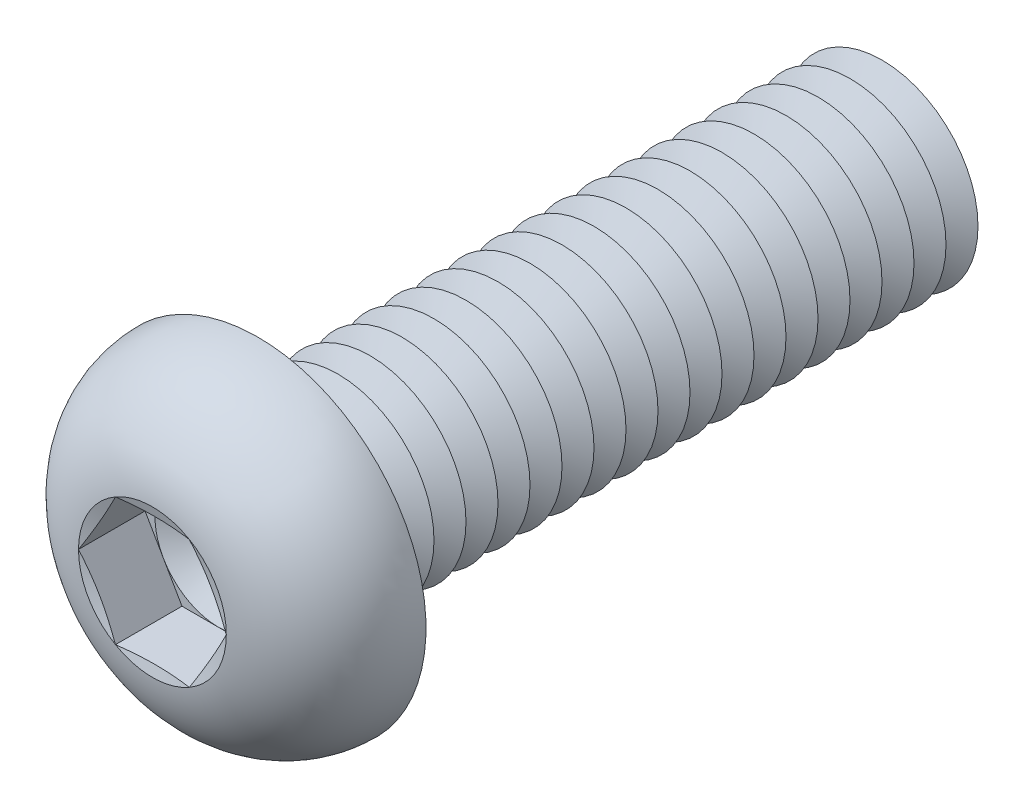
from build123d import *

# Parameters (mm, degrees)
FILLET1_R          = 0.5
LPATTERN1_COUNT    = 20
LPATTERN1_PITCH    = 1
CUT_EXTRUDE1_DEPTH = 2.08


with BuildPart() as part:
    # Sketch1 → Revolve1 (revolve)
    with BuildSketch(Plane(origin=(0, 0, 0), x_dir=(0, 0, -1), z_dir=(1, 0, 0)), mode=Mode.PRIVATE) as revolve1_sk:
        with BuildLine():
            Line((0, 3), (0, 5.25))
            ThreePointArc((0, 5.25), (-2.210041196, 4.408189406), (-3.3, 2.3094))
            Line((-3.3, 2.3094), (-2.990599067, 1.1547))
            Line((-2.990599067, 1.1547), (-3.3, 1.1547))
            Line((-3.3, 1.1547), (-3.3, 0))
            Line((-3.3, 0), (20, 0))
            Line((20, 0), (20, 3))
            Line((20, 3), (0, 3))
        make_face()
    revolve(revolve1_sk.sketch.rotate(Axis((0, 0, -20), (0, 0, 1)), 90), axis=Axis((0, 0, -20), (0, 0, 1)))

    # Fillet1
    fillet1_edges = [part.edges().sort_by_distance(p)[0] for p in [
        (3, 0, 0),
    ]]
    fillet(fillet1_edges, radius=FILLET1_R)

    # Sketch2 → Cut-Revolve1 (revolve, cut)
    with BuildSketch(Plane(origin=(0, 0, 0), x_dir=(0, 0, -1), z_dir=(1, 0, 0)), mode=Mode.PRIVATE) as cut_revolve1_sk:
        Polygon((19.5, 3), (20.5, 3), (20, 2.133974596), align=None)
    cut_revolve1 = revolve(cut_revolve1_sk.sketch.rotate(Axis((0, 0, -20), (0, 0, -1)), 270), axis=Axis((0, 0, -20), (0, 0, -1)), mode=Mode.SUBTRACT)

    # LPattern1: Cut-Revolve1 ×20
    with Locations(*[(0, 0, i * LPATTERN1_PITCH) for i in range(1, LPATTERN1_COUNT)]):
        add(cut_revolve1, mode=Mode.SUBTRACT)

    # Sketch3 → Cut-Extrude1 (cut)
    with BuildSketch(Plane.XY.offset(3.3)):
        Polygon((1.1547, 1.999999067), (-1.1547, 1.999999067), (-2.3094, 0), (-1.1547, -1.999999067), (1.1547, -1.999999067), (2.3094, 0), align=None)
    extrude(amount=-CUT_EXTRUDE1_DEPTH, mode=Mode.SUBTRACT)

    # Cut-Extrude2 cone 1 section (on through the dimple's axis) → Cut-Extrude2 (revolve, cut)
    with BuildSketch(Plane(origin=(0, 0, 1.22), x_dir=(0, -1, 0), z_dir=(1, 0, 0))):
        Polygon((0, 0), (1.999999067, 0), (0, 1.1547), align=None)
    revolve(axis=Axis((0, 0, 1.22), (0, 0, -1)), mode=Mode.SUBTRACT)


solid = part.part
